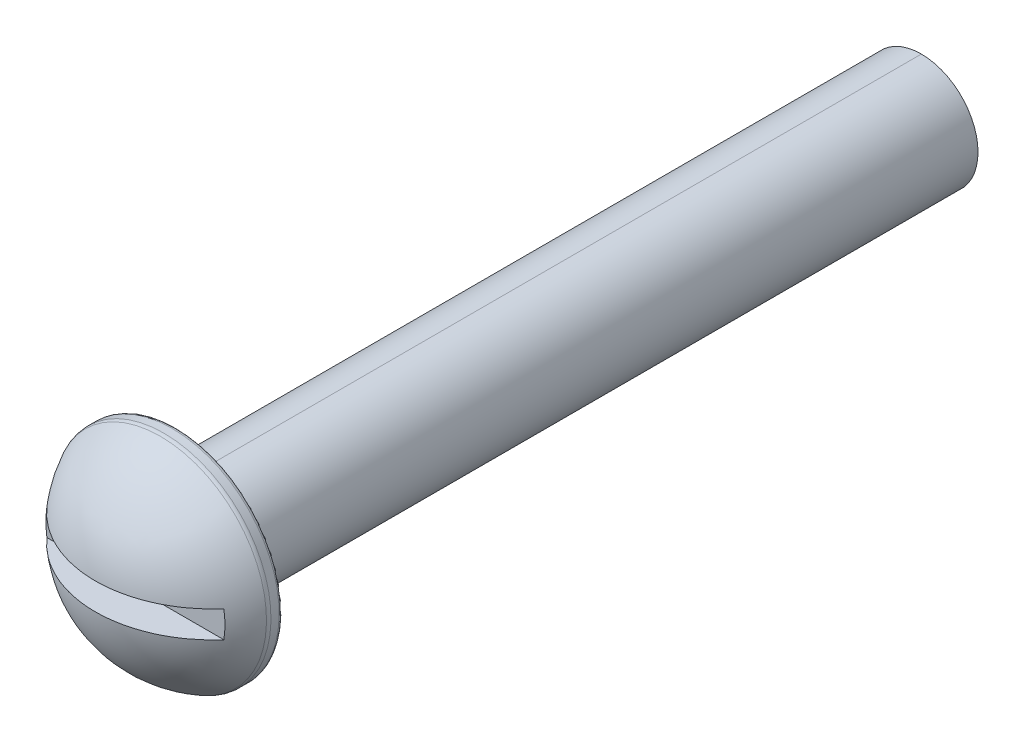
ISO-10303-21;
HEADER;
FILE_DESCRIPTION(('STEP AP214'),'2;1');
FILE_NAME('part.step','',(''),(''),'','','');
FILE_SCHEMA(('AUTOMOTIVE_DESIGN { 1 0 10303 214 1 1 1 1 }'));
ENDSEC;
DATA;
#1=APPLICATION_CONTEXT('core data for automotive mechanical design processes');
#2=APPLICATION_PROTOCOL_DEFINITION('international standard','automotive_design',2000,#1);
#3=PRODUCT_CONTEXT('',#1,'mechanical');
#4=PRODUCT('Part','Part','',(#3));
#5=PRODUCT_RELATED_PRODUCT_CATEGORY('part','',(#4));
#6=PRODUCT_DEFINITION_FORMATION('','',#4);
#7=PRODUCT_DEFINITION_CONTEXT('part definition',#1,'design');
#8=PRODUCT_DEFINITION('design','',#6,#7);
#9=PRODUCT_DEFINITION_SHAPE('','',#8);
#10=(LENGTH_UNIT() NAMED_UNIT(*) SI_UNIT(.MILLI.,.METRE.));
#11=(NAMED_UNIT(*) PLANE_ANGLE_UNIT() SI_UNIT($,.RADIAN.));
#12=(NAMED_UNIT(*) SI_UNIT($,.STERADIAN.) SOLID_ANGLE_UNIT());
#13=UNCERTAINTY_MEASURE_WITH_UNIT(LENGTH_MEASURE(1.E-05),#10,'distance_accuracy_value','');
#14=(GEOMETRIC_REPRESENTATION_CONTEXT(3) GLOBAL_UNCERTAINTY_ASSIGNED_CONTEXT((#13)) GLOBAL_UNIT_ASSIGNED_CONTEXT((#10,
#11,#12)) REPRESENTATION_CONTEXT('',''));
#15=CARTESIAN_POINT('',(0.,0.,0.));
#16=DIRECTION('',(0.,0.,1.));
#17=DIRECTION('',(1.,0.,0.));
#18=AXIS2_PLACEMENT_3D('',#15,#16,#17);
#19=CARTESIAN_POINT('',(0.,0.,-1.57085125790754));
#20=DIRECTION('',(0.,0.,-1.));
#21=DIRECTION('',(0.,1.,0.));
#22=AXIS2_PLACEMENT_3D('',#19,#20,#21);
#23=SPHERICAL_SURFACE('',#22,5.05065125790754);
#24=CARTESIAN_POINT('',(0.,0.,0.676830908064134));
#25=DIRECTION('',(0.,0.,-1.));
#26=DIRECTION('',(0.,1.,0.));
#27=AXIS2_PLACEMENT_3D('',#24,#25,#26);
#28=CIRCLE('',#27,4.52294185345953);
#29=CARTESIAN_POINT('',(0.,4.52294185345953,0.676830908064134));
#30=VERTEX_POINT('',#29);
#31=EDGE_CURVE('E94',#30,#30,#28,.T.);
#32=ORIENTED_EDGE('',*,*,#31,.F.);
#33=EDGE_LOOP('',(#32));
#34=FACE_BOUND('',#33,.T.);
#35=CARTESIAN_POINT('',(0.,0.,1.7399));
#36=DIRECTION('',(0.,0.,1.));
#37=DIRECTION('',(1.,0.,0.));
#38=AXIS2_PLACEMENT_3D('',#35,#36,#37);
#39=CIRCLE('',#38,3.81418460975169);
#40=CARTESIAN_POINT('',(-3.77136632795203,0.5699125,1.7399));
#41=VERTEX_POINT('',#40);
#42=CARTESIAN_POINT('',(-3.77136632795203,-0.5699125,1.7399));
#43=VERTEX_POINT('',#42);
#44=EDGE_CURVE('E11',#41,#43,#39,.T.);
#45=ORIENTED_EDGE('',*,*,#44,.F.);
#46=CARTESIAN_POINT('',(0.,0.5699125,-1.57085125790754));
#47=DIRECTION('',(0.,1.,0.));
#48=DIRECTION('',(0.,0.,1.));
#49=AXIS2_PLACEMENT_3D('',#46,#47,#48);
#50=CIRCLE('',#49,5.01839395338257);
#51=CARTESIAN_POINT('',(3.77136632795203,0.5699125,1.7399));
#52=VERTEX_POINT('',#51);
#53=EDGE_CURVE('E39',#41,#52,#50,.T.);
#54=ORIENTED_EDGE('',*,*,#53,.T.);
#55=CARTESIAN_POINT('',(3.77136632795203,-0.5699125,1.7399));
#56=VERTEX_POINT('',#55);
#57=EDGE_CURVE('E45',#56,#52,#39,.T.);
#58=ORIENTED_EDGE('',*,*,#57,.F.);
#59=CARTESIAN_POINT('',(0.,-0.5699125,-1.57085125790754));
#60=DIRECTION('',(0.,-1.,0.));
#61=DIRECTION('',(0.,0.,-1.));
#62=AXIS2_PLACEMENT_3D('',#59,#60,#61);
#63=CIRCLE('',#62,5.01839395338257);
#64=EDGE_CURVE('E83',#56,#43,#63,.T.);
#65=ORIENTED_EDGE('',*,*,#64,.T.);
#66=EDGE_LOOP('',(#45,#54,#58,#65));
#67=FACE_BOUND('',#66,.T.);
#68=ADVANCED_FACE('F35',(#34,#67),#23,.T.);
#69=CARTESIAN_POINT('',(0.,0.,0.));
#70=DIRECTION('',(0.,0.,1.));
#71=DIRECTION('',(1.,0.,0.));
#72=AXIS2_PLACEMENT_3D('',#69,#70,#71);
#73=PLANE('',#72);
#74=CARTESIAN_POINT('',(0.,0.,0.));
#75=DIRECTION('',(0.,0.,-1.));
#76=DIRECTION('',(0.,1.,0.));
#77=AXIS2_PLACEMENT_3D('',#74,#75,#76);
#78=CIRCLE('',#77,4.38531);
#79=CARTESIAN_POINT('',(0.,4.38531,0.));
#80=VERTEX_POINT('',#79);
#81=EDGE_CURVE('E97',#80,#80,#78,.T.);
#82=ORIENTED_EDGE('',*,*,#81,.T.);
#83=EDGE_LOOP('',(#82));
#84=FACE_BOUND('',#83,.T.);
#85=CARTESIAN_POINT('',(0.,0.,0.));
#86=DIRECTION('',(0.,0.,1.));
#87=DIRECTION('',(1.,0.,0.));
#88=AXIS2_PLACEMENT_3D('',#85,#86,#87);
#89=CIRCLE('',#88,2.41299999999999);
#90=CARTESIAN_POINT('',(0.,2.413,0.));
#91=VERTEX_POINT('',#90);
#92=CARTESIAN_POINT('',(0.,-2.41299999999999,0.));
#93=VERTEX_POINT('',#92);
#94=EDGE_CURVE('E110',#91,#93,#89,.T.);
#95=ORIENTED_EDGE('',*,*,#94,.T.);
#96=EDGE_CURVE('E58',#93,#91,#89,.T.);
#97=ORIENTED_EDGE('',*,*,#96,.T.);
#98=EDGE_LOOP('',(#95,#97));
#99=FACE_BOUND('',#98,.T.);
#100=ADVANCED_FACE('F137',(#84,#99),#73,.F.);
#101=CARTESIAN_POINT('',(0.,0.,3.4798));
#102=DIRECTION('',(0.,0.,-1.));
#103=DIRECTION('',(-1.,0.,0.));
#104=AXIS2_PLACEMENT_3D('',#101,#102,#103);
#105=CYLINDRICAL_SURFACE('',#104,4.5593);
#106=CARTESIAN_POINT('',(0.,0.,0.521969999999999));
#107=DIRECTION('',(0.,0.,-1.));
#108=DIRECTION('',(0.,1.,0.));
#109=AXIS2_PLACEMENT_3D('',#106,#107,#108);
#110=CIRCLE('',#109,4.5593);
#111=CARTESIAN_POINT('',(0.,4.5593,0.521969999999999));
#112=VERTEX_POINT('',#111);
#113=EDGE_CURVE('E91',#112,#112,#110,.T.);
#114=ORIENTED_EDGE('',*,*,#113,.T.);
#115=EDGE_LOOP('',(#114));
#116=FACE_BOUND('',#115,.T.);
#117=CARTESIAN_POINT('',(0.,0.,0.173989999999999));
#118=DIRECTION('',(0.,0.,-1.));
#119=DIRECTION('',(0.,1.,0.));
#120=AXIS2_PLACEMENT_3D('',#117,#118,#119);
#121=CIRCLE('',#120,4.5593);
#122=CARTESIAN_POINT('',(0.,4.5593,0.17399));
#123=VERTEX_POINT('',#122);
#124=EDGE_CURVE('E84',#123,#123,#121,.T.);
#125=ORIENTED_EDGE('',*,*,#124,.F.);
#126=EDGE_LOOP('',(#125));
#127=FACE_BOUND('',#126,.T.);
#128=ADVANCED_FACE('F37',(#116,#127),#105,.T.);
#129=CARTESIAN_POINT('',(0.,0.,0.173989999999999));
#130=DIRECTION('',(0.,0.,-1.));
#131=DIRECTION('',(0.,1.,0.));
#132=AXIS2_PLACEMENT_3D('',#129,#130,#131);
#133=TOROIDAL_SURFACE('',#132,4.38531,0.17399);
#134=ORIENTED_EDGE('',*,*,#81,.F.);
#135=EDGE_LOOP('',(#134));
#136=FACE_BOUND('',#135,.T.);
#137=ORIENTED_EDGE('',*,*,#124,.T.);
#138=EDGE_LOOP('',(#137));
#139=FACE_BOUND('',#138,.T.);
#140=ADVANCED_FACE('F131',(#136,#139),#133,.T.);
#141=CARTESIAN_POINT('',(0.,0.,0.521969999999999));
#142=DIRECTION('',(0.,0.,-1.));
#143=DIRECTION('',(0.,1.,0.));
#144=AXIS2_PLACEMENT_3D('',#141,#142,#143);
#145=TOROIDAL_SURFACE('',#144,4.21132,0.347980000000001);
#146=ORIENTED_EDGE('',*,*,#113,.F.);
#147=EDGE_LOOP('',(#146));
#148=FACE_BOUND('',#147,.T.);
#149=ORIENTED_EDGE('',*,*,#31,.T.);
#150=EDGE_LOOP('',(#149));
#151=FACE_BOUND('',#150,.T.);
#152=ADVANCED_FACE('F124',(#148,#151),#145,.T.);
#153=CARTESIAN_POINT('',(0.,0.,0.));
#154=DIRECTION('',(0.,0.,1.));
#155=DIRECTION('',(1.,0.,0.));
#156=AXIS2_PLACEMENT_3D('',#153,#154,#155);
#157=CYLINDRICAL_SURFACE('',#156,2.413);
#158=DIRECTION('',(0.,0.,1.));
#159=VECTOR('',#158,1.);
#160=CARTESIAN_POINT('',(0.,2.413,0.));
#161=LINE('',#160,#159);
#162=CARTESIAN_POINT('',(0.,2.413,-31.75));
#163=VERTEX_POINT('',#162);
#164=EDGE_CURVE('E100',#163,#91,#161,.T.);
#165=ORIENTED_EDGE('',*,*,#164,.F.);
#166=CARTESIAN_POINT('',(0.,0.,-31.75));
#167=DIRECTION('',(0.,0.,1.));
#168=DIRECTION('',(1.,0.,0.));
#169=AXIS2_PLACEMENT_3D('',#166,#167,#168);
#170=CIRCLE('',#169,2.413);
#171=CARTESIAN_POINT('',(0.,-2.413,-31.75));
#172=VERTEX_POINT('',#171);
#173=EDGE_CURVE('E106',#163,#172,#170,.T.);
#174=ORIENTED_EDGE('',*,*,#173,.T.);
#175=DIRECTION('',(0.,0.,1.));
#176=VECTOR('',#175,1.);
#177=CARTESIAN_POINT('',(0.,-2.413,0.));
#178=LINE('',#177,#176);
#179=EDGE_CURVE('E103',#93,#172,#178,.F.);
#180=ORIENTED_EDGE('',*,*,#179,.F.);
#181=ORIENTED_EDGE('',*,*,#94,.F.);
#182=EDGE_LOOP('',(#165,#174,#180,#181));
#183=FACE_BOUND('',#182,.T.);
#184=ADVANCED_FACE('F122',(#183),#157,.T.);
#185=CARTESIAN_POINT('',(0.,0.,-31.75));
#186=DIRECTION('',(0.,0.,1.));
#187=DIRECTION('',(1.,0.,0.));
#188=AXIS2_PLACEMENT_3D('',#185,#186,#187);
#189=PLANE('',#188);
#190=ORIENTED_EDGE('',*,*,#173,.F.);
#191=EDGE_CURVE('E109',#172,#163,#170,.T.);
#192=ORIENTED_EDGE('',*,*,#191,.F.);
#193=EDGE_LOOP('',(#190,#192));
#194=FACE_BOUND('',#193,.T.);
#195=ADVANCED_FACE('F120',(#194),#189,.F.);
#196=ORIENTED_EDGE('',*,*,#191,.T.);
#197=ORIENTED_EDGE('',*,*,#164,.T.);
#198=ORIENTED_EDGE('',*,*,#96,.F.);
#199=ORIENTED_EDGE('',*,*,#179,.T.);
#200=EDGE_LOOP('',(#196,#197,#198,#199));
#201=FACE_BOUND('',#200,.T.);
#202=ADVANCED_FACE('F118',(#201),#157,.T.);
#203=CARTESIAN_POINT('',(-4.5593,0.5699125,1.7399));
#204=DIRECTION('',(0.,1.,0.));
#205=DIRECTION('',(0.,0.,1.));
#206=AXIS2_PLACEMENT_3D('',#203,#204,#205);
#207=PLANE('',#206);
#208=DIRECTION('',(-1.,0.,0.));
#209=VECTOR('',#208,1.);
#210=CARTESIAN_POINT('',(-4.5593,0.5699125,1.7399));
#211=LINE('',#210,#209);
#212=EDGE_CURVE('E78',#52,#41,#211,.T.);
#213=ORIENTED_EDGE('',*,*,#212,.F.);
#214=ORIENTED_EDGE('',*,*,#53,.F.);
#215=EDGE_LOOP('',(#213,#214));
#216=FACE_BOUND('',#215,.T.);
#217=ADVANCED_FACE('F86',(#216),#207,.F.);
#218=CARTESIAN_POINT('',(-4.5593,-0.5699125,1.7399));
#219=DIRECTION('',(0.,-1.,0.));
#220=DIRECTION('',(0.,0.,-1.));
#221=AXIS2_PLACEMENT_3D('',#218,#219,#220);
#222=PLANE('',#221);
#223=DIRECTION('',(1.,0.,0.));
#224=VECTOR('',#223,1.);
#225=CARTESIAN_POINT('',(-4.5593,-0.5699125,1.7399));
#226=LINE('',#225,#224);
#227=EDGE_CURVE('E51',#43,#56,#226,.T.);
#228=ORIENTED_EDGE('',*,*,#227,.F.);
#229=ORIENTED_EDGE('',*,*,#64,.F.);
#230=EDGE_LOOP('',(#228,#229));
#231=FACE_BOUND('',#230,.T.);
#232=ADVANCED_FACE('F198',(#231),#222,.F.);
#233=CARTESIAN_POINT('',(-4.5593,-0.5699125,1.7399));
#234=DIRECTION('',(0.,0.,1.));
#235=DIRECTION('',(1.,0.,0.));
#236=AXIS2_PLACEMENT_3D('',#233,#234,#235);
#237=PLANE('',#236);
#238=ORIENTED_EDGE('',*,*,#44,.T.);
#239=ORIENTED_EDGE('',*,*,#227,.T.);
#240=ORIENTED_EDGE('',*,*,#57,.T.);
#241=ORIENTED_EDGE('',*,*,#212,.T.);
#242=EDGE_LOOP('',(#238,#239,#240,#241));
#243=FACE_BOUND('',#242,.T.);
#244=ADVANCED_FACE('F77',(#243),#237,.T.);
#245=CLOSED_SHELL('',(#68,#100,#128,#140,#152,#184,#195,#202,#217,#232,#244));
#246=MANIFOLD_SOLID_BREP('B2',#245);
#247=ADVANCED_BREP_SHAPE_REPRESENTATION('',(#18,#246),#14);
#248=SHAPE_DEFINITION_REPRESENTATION(#9,#247);
ENDSEC;
END-ISO-10303-21;
